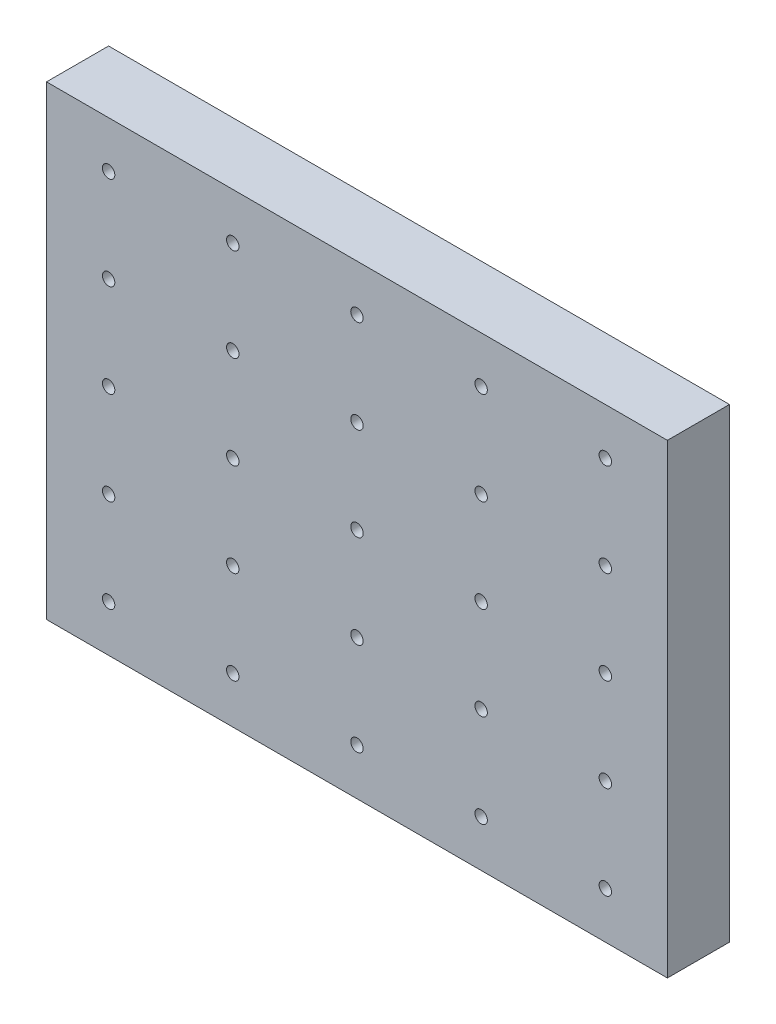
ISO-10303-21;
HEADER;
FILE_DESCRIPTION(('STEP AP214'),'2;1');
FILE_NAME('part.step','',(''),(''),'','','');
FILE_SCHEMA(('AUTOMOTIVE_DESIGN { 1 0 10303 214 1 1 1 1 }'));
ENDSEC;
DATA;
#1=APPLICATION_CONTEXT('core data for automotive mechanical design processes');
#2=APPLICATION_PROTOCOL_DEFINITION('international standard','automotive_design',2000,#1);
#3=PRODUCT_CONTEXT('',#1,'mechanical');
#4=PRODUCT('Part','Part','',(#3));
#5=PRODUCT_RELATED_PRODUCT_CATEGORY('part','',(#4));
#6=PRODUCT_DEFINITION_FORMATION('','',#4);
#7=PRODUCT_DEFINITION_CONTEXT('part definition',#1,'design');
#8=PRODUCT_DEFINITION('design','',#6,#7);
#9=PRODUCT_DEFINITION_SHAPE('','',#8);
#10=(LENGTH_UNIT() NAMED_UNIT(*) SI_UNIT(.MILLI.,.METRE.));
#11=(NAMED_UNIT(*) PLANE_ANGLE_UNIT() SI_UNIT($,.RADIAN.));
#12=(NAMED_UNIT(*) SI_UNIT($,.STERADIAN.) SOLID_ANGLE_UNIT());
#13=UNCERTAINTY_MEASURE_WITH_UNIT(LENGTH_MEASURE(1.E-05),#10,'distance_accuracy_value','');
#14=(GEOMETRIC_REPRESENTATION_CONTEXT(3) GLOBAL_UNCERTAINTY_ASSIGNED_CONTEXT((#13)) GLOBAL_UNIT_ASSIGNED_CONTEXT((#10,
#11,#12)) REPRESENTATION_CONTEXT('',''));
#15=CARTESIAN_POINT('',(0.,0.,0.));
#16=DIRECTION('',(0.,0.,1.));
#17=DIRECTION('',(1.,0.,0.));
#18=AXIS2_PLACEMENT_3D('',#15,#16,#17);
#19=CARTESIAN_POINT('',(180.,135.,20.));
#20=DIRECTION('',(0.,0.,-1.));
#21=DIRECTION('',(-1.,0.,0.));
#22=AXIS2_PLACEMENT_3D('',#19,#20,#21);
#23=CYLINDRICAL_SURFACE('',#22,2.);
#24=CARTESIAN_POINT('',(180.,135.,20.));
#25=DIRECTION('',(0.,0.,-1.));
#26=DIRECTION('',(-1.,0.,0.));
#27=AXIS2_PLACEMENT_3D('',#24,#25,#26);
#28=CIRCLE('',#27,2.);
#29=CARTESIAN_POINT('',(178.,135.,20.));
#30=VERTEX_POINT('',#29);
#31=EDGE_CURVE('E45',#30,#30,#28,.T.);
#32=ORIENTED_EDGE('',*,*,#31,.F.);
#33=EDGE_LOOP('',(#32));
#34=FACE_BOUND('',#33,.T.);
#35=CARTESIAN_POINT('',(180.,135.,0.));
#36=DIRECTION('',(0.,0.,-1.));
#37=DIRECTION('',(-1.,0.,0.));
#38=AXIS2_PLACEMENT_3D('',#35,#36,#37);
#39=CIRCLE('',#38,2.);
#40=CARTESIAN_POINT('',(178.,135.,0.));
#41=VERTEX_POINT('',#40);
#42=EDGE_CURVE('E11',#41,#41,#39,.T.);
#43=ORIENTED_EDGE('',*,*,#42,.T.);
#44=EDGE_LOOP('',(#43));
#45=FACE_BOUND('',#44,.T.);
#46=ADVANCED_FACE('F37',(#34,#45),#23,.F.);
#47=CARTESIAN_POINT('',(140.,135.,20.));
#48=DIRECTION('',(0.,0.,-1.));
#49=DIRECTION('',(-1.,0.,0.));
#50=AXIS2_PLACEMENT_3D('',#47,#48,#49);
#51=CYLINDRICAL_SURFACE('',#50,2.);
#52=CARTESIAN_POINT('',(140.,135.,20.));
#53=DIRECTION('',(0.,0.,-1.));
#54=DIRECTION('',(-1.,0.,0.));
#55=AXIS2_PLACEMENT_3D('',#52,#53,#54);
#56=CIRCLE('',#55,2.);
#57=CARTESIAN_POINT('',(138.,135.,20.));
#58=VERTEX_POINT('',#57);
#59=EDGE_CURVE('E241',#58,#58,#56,.T.);
#60=ORIENTED_EDGE('',*,*,#59,.F.);
#61=EDGE_LOOP('',(#60));
#62=FACE_BOUND('',#61,.T.);
#63=CARTESIAN_POINT('',(140.,135.,0.));
#64=DIRECTION('',(0.,0.,-1.));
#65=DIRECTION('',(-1.,0.,0.));
#66=AXIS2_PLACEMENT_3D('',#63,#64,#65);
#67=CIRCLE('',#66,2.);
#68=CARTESIAN_POINT('',(138.,135.,0.));
#69=VERTEX_POINT('',#68);
#70=EDGE_CURVE('E244',#69,#69,#67,.T.);
#71=ORIENTED_EDGE('',*,*,#70,.T.);
#72=EDGE_LOOP('',(#71));
#73=FACE_BOUND('',#72,.T.);
#74=ADVANCED_FACE('F252',(#62,#73),#51,.F.);
#75=CARTESIAN_POINT('',(100.,135.,20.));
#76=DIRECTION('',(0.,0.,-1.));
#77=DIRECTION('',(-1.,0.,0.));
#78=AXIS2_PLACEMENT_3D('',#75,#76,#77);
#79=CYLINDRICAL_SURFACE('',#78,2.);
#80=CARTESIAN_POINT('',(100.,135.,20.));
#81=DIRECTION('',(0.,0.,-1.));
#82=DIRECTION('',(-1.,0.,0.));
#83=AXIS2_PLACEMENT_3D('',#80,#81,#82);
#84=CIRCLE('',#83,2.);
#85=CARTESIAN_POINT('',(98.,135.,20.));
#86=VERTEX_POINT('',#85);
#87=EDGE_CURVE('E235',#86,#86,#84,.T.);
#88=ORIENTED_EDGE('',*,*,#87,.F.);
#89=EDGE_LOOP('',(#88));
#90=FACE_BOUND('',#89,.T.);
#91=CARTESIAN_POINT('',(100.,135.,0.));
#92=DIRECTION('',(0.,0.,-1.));
#93=DIRECTION('',(-1.,0.,0.));
#94=AXIS2_PLACEMENT_3D('',#91,#92,#93);
#95=CIRCLE('',#94,2.);
#96=CARTESIAN_POINT('',(98.,135.,0.));
#97=VERTEX_POINT('',#96);
#98=EDGE_CURVE('E238',#97,#97,#95,.T.);
#99=ORIENTED_EDGE('',*,*,#98,.T.);
#100=EDGE_LOOP('',(#99));
#101=FACE_BOUND('',#100,.T.);
#102=ADVANCED_FACE('F362',(#90,#101),#79,.F.);
#103=CARTESIAN_POINT('',(60.,135.,20.));
#104=DIRECTION('',(0.,0.,-1.));
#105=DIRECTION('',(-1.,0.,0.));
#106=AXIS2_PLACEMENT_3D('',#103,#104,#105);
#107=CYLINDRICAL_SURFACE('',#106,2.);
#108=CARTESIAN_POINT('',(60.,135.,20.));
#109=DIRECTION('',(0.,0.,-1.));
#110=DIRECTION('',(-1.,0.,0.));
#111=AXIS2_PLACEMENT_3D('',#108,#109,#110);
#112=CIRCLE('',#111,2.);
#113=CARTESIAN_POINT('',(58.,135.,20.));
#114=VERTEX_POINT('',#113);
#115=EDGE_CURVE('E229',#114,#114,#112,.T.);
#116=ORIENTED_EDGE('',*,*,#115,.F.);
#117=EDGE_LOOP('',(#116));
#118=FACE_BOUND('',#117,.T.);
#119=CARTESIAN_POINT('',(60.,135.,0.));
#120=DIRECTION('',(0.,0.,-1.));
#121=DIRECTION('',(-1.,0.,0.));
#122=AXIS2_PLACEMENT_3D('',#119,#120,#121);
#123=CIRCLE('',#122,2.);
#124=CARTESIAN_POINT('',(58.,135.,0.));
#125=VERTEX_POINT('',#124);
#126=EDGE_CURVE('E232',#125,#125,#123,.T.);
#127=ORIENTED_EDGE('',*,*,#126,.T.);
#128=EDGE_LOOP('',(#127));
#129=FACE_BOUND('',#128,.T.);
#130=ADVANCED_FACE('F358',(#118,#129),#107,.F.);
#131=CARTESIAN_POINT('',(20.,135.,20.));
#132=DIRECTION('',(0.,0.,-1.));
#133=DIRECTION('',(-1.,0.,0.));
#134=AXIS2_PLACEMENT_3D('',#131,#132,#133);
#135=CYLINDRICAL_SURFACE('',#134,2.);
#136=CARTESIAN_POINT('',(20.,135.,20.));
#137=DIRECTION('',(0.,0.,-1.));
#138=DIRECTION('',(-1.,0.,0.));
#139=AXIS2_PLACEMENT_3D('',#136,#137,#138);
#140=CIRCLE('',#139,2.);
#141=CARTESIAN_POINT('',(18.,135.,20.));
#142=VERTEX_POINT('',#141);
#143=EDGE_CURVE('E223',#142,#142,#140,.T.);
#144=ORIENTED_EDGE('',*,*,#143,.F.);
#145=EDGE_LOOP('',(#144));
#146=FACE_BOUND('',#145,.T.);
#147=CARTESIAN_POINT('',(20.,135.,0.));
#148=DIRECTION('',(0.,0.,-1.));
#149=DIRECTION('',(-1.,0.,0.));
#150=AXIS2_PLACEMENT_3D('',#147,#148,#149);
#151=CIRCLE('',#150,2.);
#152=CARTESIAN_POINT('',(18.,135.,0.));
#153=VERTEX_POINT('',#152);
#154=EDGE_CURVE('E226',#153,#153,#151,.T.);
#155=ORIENTED_EDGE('',*,*,#154,.T.);
#156=EDGE_LOOP('',(#155));
#157=FACE_BOUND('',#156,.T.);
#158=ADVANCED_FACE('F354',(#146,#157),#135,.F.);
#159=CARTESIAN_POINT('',(180.,105.,20.));
#160=DIRECTION('',(0.,0.,-1.));
#161=DIRECTION('',(-1.,0.,0.));
#162=AXIS2_PLACEMENT_3D('',#159,#160,#161);
#163=CYLINDRICAL_SURFACE('',#162,2.);
#164=CARTESIAN_POINT('',(180.,105.,20.));
#165=DIRECTION('',(0.,0.,-1.));
#166=DIRECTION('',(-1.,0.,0.));
#167=AXIS2_PLACEMENT_3D('',#164,#165,#166);
#168=CIRCLE('',#167,2.);
#169=CARTESIAN_POINT('',(178.,105.,20.));
#170=VERTEX_POINT('',#169);
#171=EDGE_CURVE('E217',#170,#170,#168,.T.);
#172=ORIENTED_EDGE('',*,*,#171,.F.);
#173=EDGE_LOOP('',(#172));
#174=FACE_BOUND('',#173,.T.);
#175=CARTESIAN_POINT('',(180.,105.,0.));
#176=DIRECTION('',(0.,0.,-1.));
#177=DIRECTION('',(-1.,0.,0.));
#178=AXIS2_PLACEMENT_3D('',#175,#176,#177);
#179=CIRCLE('',#178,2.);
#180=CARTESIAN_POINT('',(178.,105.,0.));
#181=VERTEX_POINT('',#180);
#182=EDGE_CURVE('E220',#181,#181,#179,.T.);
#183=ORIENTED_EDGE('',*,*,#182,.T.);
#184=EDGE_LOOP('',(#183));
#185=FACE_BOUND('',#184,.T.);
#186=ADVANCED_FACE('F350',(#174,#185),#163,.F.);
#187=CARTESIAN_POINT('',(140.,105.,20.));
#188=DIRECTION('',(0.,0.,-1.));
#189=DIRECTION('',(-1.,0.,0.));
#190=AXIS2_PLACEMENT_3D('',#187,#188,#189);
#191=CYLINDRICAL_SURFACE('',#190,2.);
#192=CARTESIAN_POINT('',(140.,105.,20.));
#193=DIRECTION('',(0.,0.,-1.));
#194=DIRECTION('',(-1.,0.,0.));
#195=AXIS2_PLACEMENT_3D('',#192,#193,#194);
#196=CIRCLE('',#195,2.);
#197=CARTESIAN_POINT('',(138.,105.,20.));
#198=VERTEX_POINT('',#197);
#199=EDGE_CURVE('E211',#198,#198,#196,.T.);
#200=ORIENTED_EDGE('',*,*,#199,.F.);
#201=EDGE_LOOP('',(#200));
#202=FACE_BOUND('',#201,.T.);
#203=CARTESIAN_POINT('',(140.,105.,0.));
#204=DIRECTION('',(0.,0.,-1.));
#205=DIRECTION('',(-1.,0.,0.));
#206=AXIS2_PLACEMENT_3D('',#203,#204,#205);
#207=CIRCLE('',#206,2.);
#208=CARTESIAN_POINT('',(138.,105.,0.));
#209=VERTEX_POINT('',#208);
#210=EDGE_CURVE('E214',#209,#209,#207,.T.);
#211=ORIENTED_EDGE('',*,*,#210,.T.);
#212=EDGE_LOOP('',(#211));
#213=FACE_BOUND('',#212,.T.);
#214=ADVANCED_FACE('F346',(#202,#213),#191,.F.);
#215=CARTESIAN_POINT('',(100.,105.,20.));
#216=DIRECTION('',(0.,0.,-1.));
#217=DIRECTION('',(-1.,0.,0.));
#218=AXIS2_PLACEMENT_3D('',#215,#216,#217);
#219=CYLINDRICAL_SURFACE('',#218,2.);
#220=CARTESIAN_POINT('',(100.,105.,20.));
#221=DIRECTION('',(0.,0.,-1.));
#222=DIRECTION('',(-1.,0.,0.));
#223=AXIS2_PLACEMENT_3D('',#220,#221,#222);
#224=CIRCLE('',#223,2.);
#225=CARTESIAN_POINT('',(98.,105.,20.));
#226=VERTEX_POINT('',#225);
#227=EDGE_CURVE('E205',#226,#226,#224,.T.);
#228=ORIENTED_EDGE('',*,*,#227,.F.);
#229=EDGE_LOOP('',(#228));
#230=FACE_BOUND('',#229,.T.);
#231=CARTESIAN_POINT('',(100.,105.,0.));
#232=DIRECTION('',(0.,0.,-1.));
#233=DIRECTION('',(-1.,0.,0.));
#234=AXIS2_PLACEMENT_3D('',#231,#232,#233);
#235=CIRCLE('',#234,2.);
#236=CARTESIAN_POINT('',(98.,105.,0.));
#237=VERTEX_POINT('',#236);
#238=EDGE_CURVE('E208',#237,#237,#235,.T.);
#239=ORIENTED_EDGE('',*,*,#238,.T.);
#240=EDGE_LOOP('',(#239));
#241=FACE_BOUND('',#240,.T.);
#242=ADVANCED_FACE('F342',(#230,#241),#219,.F.);
#243=CARTESIAN_POINT('',(60.,105.,20.));
#244=DIRECTION('',(0.,0.,-1.));
#245=DIRECTION('',(-1.,0.,0.));
#246=AXIS2_PLACEMENT_3D('',#243,#244,#245);
#247=CYLINDRICAL_SURFACE('',#246,2.);
#248=CARTESIAN_POINT('',(60.,105.,20.));
#249=DIRECTION('',(0.,0.,-1.));
#250=DIRECTION('',(-1.,0.,0.));
#251=AXIS2_PLACEMENT_3D('',#248,#249,#250);
#252=CIRCLE('',#251,2.);
#253=CARTESIAN_POINT('',(58.,105.,20.));
#254=VERTEX_POINT('',#253);
#255=EDGE_CURVE('E199',#254,#254,#252,.T.);
#256=ORIENTED_EDGE('',*,*,#255,.F.);
#257=EDGE_LOOP('',(#256));
#258=FACE_BOUND('',#257,.T.);
#259=CARTESIAN_POINT('',(60.,105.,0.));
#260=DIRECTION('',(0.,0.,-1.));
#261=DIRECTION('',(-1.,0.,0.));
#262=AXIS2_PLACEMENT_3D('',#259,#260,#261);
#263=CIRCLE('',#262,2.);
#264=CARTESIAN_POINT('',(58.,105.,0.));
#265=VERTEX_POINT('',#264);
#266=EDGE_CURVE('E202',#265,#265,#263,.T.);
#267=ORIENTED_EDGE('',*,*,#266,.T.);
#268=EDGE_LOOP('',(#267));
#269=FACE_BOUND('',#268,.T.);
#270=ADVANCED_FACE('F338',(#258,#269),#247,.F.);
#271=CARTESIAN_POINT('',(20.,105.,20.));
#272=DIRECTION('',(0.,0.,-1.));
#273=DIRECTION('',(-1.,0.,0.));
#274=AXIS2_PLACEMENT_3D('',#271,#272,#273);
#275=CYLINDRICAL_SURFACE('',#274,2.);
#276=CARTESIAN_POINT('',(20.,105.,20.));
#277=DIRECTION('',(0.,0.,-1.));
#278=DIRECTION('',(-1.,0.,0.));
#279=AXIS2_PLACEMENT_3D('',#276,#277,#278);
#280=CIRCLE('',#279,2.);
#281=CARTESIAN_POINT('',(18.,105.,20.));
#282=VERTEX_POINT('',#281);
#283=EDGE_CURVE('E193',#282,#282,#280,.T.);
#284=ORIENTED_EDGE('',*,*,#283,.F.);
#285=EDGE_LOOP('',(#284));
#286=FACE_BOUND('',#285,.T.);
#287=CARTESIAN_POINT('',(20.,105.,0.));
#288=DIRECTION('',(0.,0.,-1.));
#289=DIRECTION('',(-1.,0.,0.));
#290=AXIS2_PLACEMENT_3D('',#287,#288,#289);
#291=CIRCLE('',#290,2.);
#292=CARTESIAN_POINT('',(18.,105.,0.));
#293=VERTEX_POINT('',#292);
#294=EDGE_CURVE('E196',#293,#293,#291,.T.);
#295=ORIENTED_EDGE('',*,*,#294,.T.);
#296=EDGE_LOOP('',(#295));
#297=FACE_BOUND('',#296,.T.);
#298=ADVANCED_FACE('F334',(#286,#297),#275,.F.);
#299=CARTESIAN_POINT('',(180.,75.,20.));
#300=DIRECTION('',(0.,0.,-1.));
#301=DIRECTION('',(-1.,0.,0.));
#302=AXIS2_PLACEMENT_3D('',#299,#300,#301);
#303=CYLINDRICAL_SURFACE('',#302,2.);
#304=CARTESIAN_POINT('',(180.,75.,20.));
#305=DIRECTION('',(0.,0.,-1.));
#306=DIRECTION('',(-1.,0.,0.));
#307=AXIS2_PLACEMENT_3D('',#304,#305,#306);
#308=CIRCLE('',#307,2.);
#309=CARTESIAN_POINT('',(178.,75.,20.));
#310=VERTEX_POINT('',#309);
#311=EDGE_CURVE('E187',#310,#310,#308,.T.);
#312=ORIENTED_EDGE('',*,*,#311,.F.);
#313=EDGE_LOOP('',(#312));
#314=FACE_BOUND('',#313,.T.);
#315=CARTESIAN_POINT('',(180.,75.,0.));
#316=DIRECTION('',(0.,0.,-1.));
#317=DIRECTION('',(-1.,0.,0.));
#318=AXIS2_PLACEMENT_3D('',#315,#316,#317);
#319=CIRCLE('',#318,2.);
#320=CARTESIAN_POINT('',(178.,75.,0.));
#321=VERTEX_POINT('',#320);
#322=EDGE_CURVE('E190',#321,#321,#319,.T.);
#323=ORIENTED_EDGE('',*,*,#322,.T.);
#324=EDGE_LOOP('',(#323));
#325=FACE_BOUND('',#324,.T.);
#326=ADVANCED_FACE('F330',(#314,#325),#303,.F.);
#327=CARTESIAN_POINT('',(140.,75.,20.));
#328=DIRECTION('',(0.,0.,-1.));
#329=DIRECTION('',(-1.,0.,0.));
#330=AXIS2_PLACEMENT_3D('',#327,#328,#329);
#331=CYLINDRICAL_SURFACE('',#330,2.);
#332=CARTESIAN_POINT('',(140.,75.,20.));
#333=DIRECTION('',(0.,0.,-1.));
#334=DIRECTION('',(-1.,0.,0.));
#335=AXIS2_PLACEMENT_3D('',#332,#333,#334);
#336=CIRCLE('',#335,2.);
#337=CARTESIAN_POINT('',(138.,75.,20.));
#338=VERTEX_POINT('',#337);
#339=EDGE_CURVE('E181',#338,#338,#336,.T.);
#340=ORIENTED_EDGE('',*,*,#339,.F.);
#341=EDGE_LOOP('',(#340));
#342=FACE_BOUND('',#341,.T.);
#343=CARTESIAN_POINT('',(140.,75.,0.));
#344=DIRECTION('',(0.,0.,-1.));
#345=DIRECTION('',(-1.,0.,0.));
#346=AXIS2_PLACEMENT_3D('',#343,#344,#345);
#347=CIRCLE('',#346,2.);
#348=CARTESIAN_POINT('',(138.,75.,0.));
#349=VERTEX_POINT('',#348);
#350=EDGE_CURVE('E184',#349,#349,#347,.T.);
#351=ORIENTED_EDGE('',*,*,#350,.T.);
#352=EDGE_LOOP('',(#351));
#353=FACE_BOUND('',#352,.T.);
#354=ADVANCED_FACE('F326',(#342,#353),#331,.F.);
#355=CARTESIAN_POINT('',(100.,75.,20.));
#356=DIRECTION('',(0.,0.,-1.));
#357=DIRECTION('',(-1.,0.,0.));
#358=AXIS2_PLACEMENT_3D('',#355,#356,#357);
#359=CYLINDRICAL_SURFACE('',#358,2.);
#360=CARTESIAN_POINT('',(100.,75.,20.));
#361=DIRECTION('',(0.,0.,-1.));
#362=DIRECTION('',(-1.,0.,0.));
#363=AXIS2_PLACEMENT_3D('',#360,#361,#362);
#364=CIRCLE('',#363,2.);
#365=CARTESIAN_POINT('',(98.,75.,20.));
#366=VERTEX_POINT('',#365);
#367=EDGE_CURVE('E175',#366,#366,#364,.T.);
#368=ORIENTED_EDGE('',*,*,#367,.F.);
#369=EDGE_LOOP('',(#368));
#370=FACE_BOUND('',#369,.T.);
#371=CARTESIAN_POINT('',(100.,75.,0.));
#372=DIRECTION('',(0.,0.,-1.));
#373=DIRECTION('',(-1.,0.,0.));
#374=AXIS2_PLACEMENT_3D('',#371,#372,#373);
#375=CIRCLE('',#374,2.);
#376=CARTESIAN_POINT('',(98.,75.,0.));
#377=VERTEX_POINT('',#376);
#378=EDGE_CURVE('E178',#377,#377,#375,.T.);
#379=ORIENTED_EDGE('',*,*,#378,.T.);
#380=EDGE_LOOP('',(#379));
#381=FACE_BOUND('',#380,.T.);
#382=ADVANCED_FACE('F322',(#370,#381),#359,.F.);
#383=CARTESIAN_POINT('',(60.,75.,20.));
#384=DIRECTION('',(0.,0.,-1.));
#385=DIRECTION('',(-1.,0.,0.));
#386=AXIS2_PLACEMENT_3D('',#383,#384,#385);
#387=CYLINDRICAL_SURFACE('',#386,2.);
#388=CARTESIAN_POINT('',(60.,75.,20.));
#389=DIRECTION('',(0.,0.,-1.));
#390=DIRECTION('',(-1.,0.,0.));
#391=AXIS2_PLACEMENT_3D('',#388,#389,#390);
#392=CIRCLE('',#391,2.);
#393=CARTESIAN_POINT('',(58.,75.,20.));
#394=VERTEX_POINT('',#393);
#395=EDGE_CURVE('E169',#394,#394,#392,.T.);
#396=ORIENTED_EDGE('',*,*,#395,.F.);
#397=EDGE_LOOP('',(#396));
#398=FACE_BOUND('',#397,.T.);
#399=CARTESIAN_POINT('',(60.,75.,0.));
#400=DIRECTION('',(0.,0.,-1.));
#401=DIRECTION('',(-1.,0.,0.));
#402=AXIS2_PLACEMENT_3D('',#399,#400,#401);
#403=CIRCLE('',#402,2.);
#404=CARTESIAN_POINT('',(58.,75.,0.));
#405=VERTEX_POINT('',#404);
#406=EDGE_CURVE('E172',#405,#405,#403,.T.);
#407=ORIENTED_EDGE('',*,*,#406,.T.);
#408=EDGE_LOOP('',(#407));
#409=FACE_BOUND('',#408,.T.);
#410=ADVANCED_FACE('F318',(#398,#409),#387,.F.);
#411=CARTESIAN_POINT('',(20.,75.,20.));
#412=DIRECTION('',(0.,0.,-1.));
#413=DIRECTION('',(-1.,0.,0.));
#414=AXIS2_PLACEMENT_3D('',#411,#412,#413);
#415=CYLINDRICAL_SURFACE('',#414,2.);
#416=CARTESIAN_POINT('',(20.,75.,20.));
#417=DIRECTION('',(0.,0.,-1.));
#418=DIRECTION('',(-1.,0.,0.));
#419=AXIS2_PLACEMENT_3D('',#416,#417,#418);
#420=CIRCLE('',#419,2.);
#421=CARTESIAN_POINT('',(18.,75.,20.));
#422=VERTEX_POINT('',#421);
#423=EDGE_CURVE('E163',#422,#422,#420,.T.);
#424=ORIENTED_EDGE('',*,*,#423,.F.);
#425=EDGE_LOOP('',(#424));
#426=FACE_BOUND('',#425,.T.);
#427=CARTESIAN_POINT('',(20.,75.,0.));
#428=DIRECTION('',(0.,0.,-1.));
#429=DIRECTION('',(-1.,0.,0.));
#430=AXIS2_PLACEMENT_3D('',#427,#428,#429);
#431=CIRCLE('',#430,2.);
#432=CARTESIAN_POINT('',(18.,75.,0.));
#433=VERTEX_POINT('',#432);
#434=EDGE_CURVE('E166',#433,#433,#431,.T.);
#435=ORIENTED_EDGE('',*,*,#434,.T.);
#436=EDGE_LOOP('',(#435));
#437=FACE_BOUND('',#436,.T.);
#438=ADVANCED_FACE('F314',(#426,#437),#415,.F.);
#439=CARTESIAN_POINT('',(180.,45.,20.));
#440=DIRECTION('',(0.,0.,-1.));
#441=DIRECTION('',(-1.,0.,0.));
#442=AXIS2_PLACEMENT_3D('',#439,#440,#441);
#443=CYLINDRICAL_SURFACE('',#442,2.);
#444=CARTESIAN_POINT('',(180.,45.,20.));
#445=DIRECTION('',(0.,0.,-1.));
#446=DIRECTION('',(-1.,0.,0.));
#447=AXIS2_PLACEMENT_3D('',#444,#445,#446);
#448=CIRCLE('',#447,2.);
#449=CARTESIAN_POINT('',(178.,45.,20.));
#450=VERTEX_POINT('',#449);
#451=EDGE_CURVE('E157',#450,#450,#448,.T.);
#452=ORIENTED_EDGE('',*,*,#451,.F.);
#453=EDGE_LOOP('',(#452));
#454=FACE_BOUND('',#453,.T.);
#455=CARTESIAN_POINT('',(180.,45.,0.));
#456=DIRECTION('',(0.,0.,-1.));
#457=DIRECTION('',(-1.,0.,0.));
#458=AXIS2_PLACEMENT_3D('',#455,#456,#457);
#459=CIRCLE('',#458,2.);
#460=CARTESIAN_POINT('',(178.,45.,0.));
#461=VERTEX_POINT('',#460);
#462=EDGE_CURVE('E160',#461,#461,#459,.T.);
#463=ORIENTED_EDGE('',*,*,#462,.T.);
#464=EDGE_LOOP('',(#463));
#465=FACE_BOUND('',#464,.T.);
#466=ADVANCED_FACE('F310',(#454,#465),#443,.F.);
#467=CARTESIAN_POINT('',(140.,45.,20.));
#468=DIRECTION('',(0.,0.,-1.));
#469=DIRECTION('',(-1.,0.,0.));
#470=AXIS2_PLACEMENT_3D('',#467,#468,#469);
#471=CYLINDRICAL_SURFACE('',#470,2.);
#472=CARTESIAN_POINT('',(140.,45.,20.));
#473=DIRECTION('',(0.,0.,-1.));
#474=DIRECTION('',(-1.,0.,0.));
#475=AXIS2_PLACEMENT_3D('',#472,#473,#474);
#476=CIRCLE('',#475,2.);
#477=CARTESIAN_POINT('',(138.,45.,20.));
#478=VERTEX_POINT('',#477);
#479=EDGE_CURVE('E151',#478,#478,#476,.T.);
#480=ORIENTED_EDGE('',*,*,#479,.F.);
#481=EDGE_LOOP('',(#480));
#482=FACE_BOUND('',#481,.T.);
#483=CARTESIAN_POINT('',(140.,45.,0.));
#484=DIRECTION('',(0.,0.,-1.));
#485=DIRECTION('',(-1.,0.,0.));
#486=AXIS2_PLACEMENT_3D('',#483,#484,#485);
#487=CIRCLE('',#486,2.);
#488=CARTESIAN_POINT('',(138.,45.,0.));
#489=VERTEX_POINT('',#488);
#490=EDGE_CURVE('E154',#489,#489,#487,.T.);
#491=ORIENTED_EDGE('',*,*,#490,.T.);
#492=EDGE_LOOP('',(#491));
#493=FACE_BOUND('',#492,.T.);
#494=ADVANCED_FACE('F306',(#482,#493),#471,.F.);
#495=CARTESIAN_POINT('',(100.,45.,20.));
#496=DIRECTION('',(0.,0.,-1.));
#497=DIRECTION('',(-1.,0.,0.));
#498=AXIS2_PLACEMENT_3D('',#495,#496,#497);
#499=CYLINDRICAL_SURFACE('',#498,2.);
#500=CARTESIAN_POINT('',(100.,45.,20.));
#501=DIRECTION('',(0.,0.,-1.));
#502=DIRECTION('',(-1.,0.,0.));
#503=AXIS2_PLACEMENT_3D('',#500,#501,#502);
#504=CIRCLE('',#503,2.);
#505=CARTESIAN_POINT('',(98.,45.,20.));
#506=VERTEX_POINT('',#505);
#507=EDGE_CURVE('E145',#506,#506,#504,.T.);
#508=ORIENTED_EDGE('',*,*,#507,.F.);
#509=EDGE_LOOP('',(#508));
#510=FACE_BOUND('',#509,.T.);
#511=CARTESIAN_POINT('',(100.,45.,0.));
#512=DIRECTION('',(0.,0.,-1.));
#513=DIRECTION('',(-1.,0.,0.));
#514=AXIS2_PLACEMENT_3D('',#511,#512,#513);
#515=CIRCLE('',#514,2.);
#516=CARTESIAN_POINT('',(98.,45.,0.));
#517=VERTEX_POINT('',#516);
#518=EDGE_CURVE('E148',#517,#517,#515,.T.);
#519=ORIENTED_EDGE('',*,*,#518,.T.);
#520=EDGE_LOOP('',(#519));
#521=FACE_BOUND('',#520,.T.);
#522=ADVANCED_FACE('F302',(#510,#521),#499,.F.);
#523=CARTESIAN_POINT('',(60.,45.,20.));
#524=DIRECTION('',(0.,0.,-1.));
#525=DIRECTION('',(-1.,0.,0.));
#526=AXIS2_PLACEMENT_3D('',#523,#524,#525);
#527=CYLINDRICAL_SURFACE('',#526,2.);
#528=CARTESIAN_POINT('',(60.,45.,20.));
#529=DIRECTION('',(0.,0.,-1.));
#530=DIRECTION('',(-1.,0.,0.));
#531=AXIS2_PLACEMENT_3D('',#528,#529,#530);
#532=CIRCLE('',#531,2.);
#533=CARTESIAN_POINT('',(58.,45.,20.));
#534=VERTEX_POINT('',#533);
#535=EDGE_CURVE('E139',#534,#534,#532,.T.);
#536=ORIENTED_EDGE('',*,*,#535,.F.);
#537=EDGE_LOOP('',(#536));
#538=FACE_BOUND('',#537,.T.);
#539=CARTESIAN_POINT('',(60.,45.,0.));
#540=DIRECTION('',(0.,0.,-1.));
#541=DIRECTION('',(-1.,0.,0.));
#542=AXIS2_PLACEMENT_3D('',#539,#540,#541);
#543=CIRCLE('',#542,2.);
#544=CARTESIAN_POINT('',(58.,45.,0.));
#545=VERTEX_POINT('',#544);
#546=EDGE_CURVE('E142',#545,#545,#543,.T.);
#547=ORIENTED_EDGE('',*,*,#546,.T.);
#548=EDGE_LOOP('',(#547));
#549=FACE_BOUND('',#548,.T.);
#550=ADVANCED_FACE('F298',(#538,#549),#527,.F.);
#551=CARTESIAN_POINT('',(20.,45.,20.));
#552=DIRECTION('',(0.,0.,-1.));
#553=DIRECTION('',(-1.,0.,0.));
#554=AXIS2_PLACEMENT_3D('',#551,#552,#553);
#555=CYLINDRICAL_SURFACE('',#554,2.);
#556=CARTESIAN_POINT('',(20.,45.,20.));
#557=DIRECTION('',(0.,0.,-1.));
#558=DIRECTION('',(-1.,0.,0.));
#559=AXIS2_PLACEMENT_3D('',#556,#557,#558);
#560=CIRCLE('',#559,2.);
#561=CARTESIAN_POINT('',(18.,45.,20.));
#562=VERTEX_POINT('',#561);
#563=EDGE_CURVE('E133',#562,#562,#560,.T.);
#564=ORIENTED_EDGE('',*,*,#563,.F.);
#565=EDGE_LOOP('',(#564));
#566=FACE_BOUND('',#565,.T.);
#567=CARTESIAN_POINT('',(20.,45.,0.));
#568=DIRECTION('',(0.,0.,-1.));
#569=DIRECTION('',(-1.,0.,0.));
#570=AXIS2_PLACEMENT_3D('',#567,#568,#569);
#571=CIRCLE('',#570,2.);
#572=CARTESIAN_POINT('',(18.,45.,0.));
#573=VERTEX_POINT('',#572);
#574=EDGE_CURVE('E136',#573,#573,#571,.T.);
#575=ORIENTED_EDGE('',*,*,#574,.T.);
#576=EDGE_LOOP('',(#575));
#577=FACE_BOUND('',#576,.T.);
#578=ADVANCED_FACE('F294',(#566,#577),#555,.F.);
#579=CARTESIAN_POINT('',(180.,15.,20.));
#580=DIRECTION('',(0.,0.,-1.));
#581=DIRECTION('',(-1.,0.,0.));
#582=AXIS2_PLACEMENT_3D('',#579,#580,#581);
#583=CYLINDRICAL_SURFACE('',#582,2.);
#584=CARTESIAN_POINT('',(180.,15.,20.));
#585=DIRECTION('',(0.,0.,-1.));
#586=DIRECTION('',(-1.,0.,0.));
#587=AXIS2_PLACEMENT_3D('',#584,#585,#586);
#588=CIRCLE('',#587,2.);
#589=CARTESIAN_POINT('',(178.,15.,20.));
#590=VERTEX_POINT('',#589);
#591=EDGE_CURVE('E127',#590,#590,#588,.T.);
#592=ORIENTED_EDGE('',*,*,#591,.F.);
#593=EDGE_LOOP('',(#592));
#594=FACE_BOUND('',#593,.T.);
#595=CARTESIAN_POINT('',(180.,15.,0.));
#596=DIRECTION('',(0.,0.,-1.));
#597=DIRECTION('',(-1.,0.,0.));
#598=AXIS2_PLACEMENT_3D('',#595,#596,#597);
#599=CIRCLE('',#598,2.);
#600=CARTESIAN_POINT('',(178.,15.,0.));
#601=VERTEX_POINT('',#600);
#602=EDGE_CURVE('E130',#601,#601,#599,.T.);
#603=ORIENTED_EDGE('',*,*,#602,.T.);
#604=EDGE_LOOP('',(#603));
#605=FACE_BOUND('',#604,.T.);
#606=ADVANCED_FACE('F290',(#594,#605),#583,.F.);
#607=CARTESIAN_POINT('',(140.,15.,20.));
#608=DIRECTION('',(0.,0.,-1.));
#609=DIRECTION('',(-1.,0.,0.));
#610=AXIS2_PLACEMENT_3D('',#607,#608,#609);
#611=CYLINDRICAL_SURFACE('',#610,2.);
#612=CARTESIAN_POINT('',(140.,15.,20.));
#613=DIRECTION('',(0.,0.,-1.));
#614=DIRECTION('',(-1.,0.,0.));
#615=AXIS2_PLACEMENT_3D('',#612,#613,#614);
#616=CIRCLE('',#615,2.);
#617=CARTESIAN_POINT('',(138.,15.,20.));
#618=VERTEX_POINT('',#617);
#619=EDGE_CURVE('E121',#618,#618,#616,.T.);
#620=ORIENTED_EDGE('',*,*,#619,.F.);
#621=EDGE_LOOP('',(#620));
#622=FACE_BOUND('',#621,.T.);
#623=CARTESIAN_POINT('',(140.,15.,0.));
#624=DIRECTION('',(0.,0.,-1.));
#625=DIRECTION('',(-1.,0.,0.));
#626=AXIS2_PLACEMENT_3D('',#623,#624,#625);
#627=CIRCLE('',#626,2.);
#628=CARTESIAN_POINT('',(138.,15.,0.));
#629=VERTEX_POINT('',#628);
#630=EDGE_CURVE('E124',#629,#629,#627,.T.);
#631=ORIENTED_EDGE('',*,*,#630,.T.);
#632=EDGE_LOOP('',(#631));
#633=FACE_BOUND('',#632,.T.);
#634=ADVANCED_FACE('F286',(#622,#633),#611,.F.);
#635=CARTESIAN_POINT('',(100.,15.,20.));
#636=DIRECTION('',(0.,0.,-1.));
#637=DIRECTION('',(-1.,0.,0.));
#638=AXIS2_PLACEMENT_3D('',#635,#636,#637);
#639=CYLINDRICAL_SURFACE('',#638,2.);
#640=CARTESIAN_POINT('',(100.,15.,20.));
#641=DIRECTION('',(0.,0.,-1.));
#642=DIRECTION('',(-1.,0.,0.));
#643=AXIS2_PLACEMENT_3D('',#640,#641,#642);
#644=CIRCLE('',#643,2.);
#645=CARTESIAN_POINT('',(98.,15.,20.));
#646=VERTEX_POINT('',#645);
#647=EDGE_CURVE('E115',#646,#646,#644,.T.);
#648=ORIENTED_EDGE('',*,*,#647,.F.);
#649=EDGE_LOOP('',(#648));
#650=FACE_BOUND('',#649,.T.);
#651=CARTESIAN_POINT('',(100.,15.,0.));
#652=DIRECTION('',(0.,0.,-1.));
#653=DIRECTION('',(-1.,0.,0.));
#654=AXIS2_PLACEMENT_3D('',#651,#652,#653);
#655=CIRCLE('',#654,2.);
#656=CARTESIAN_POINT('',(98.,15.,0.));
#657=VERTEX_POINT('',#656);
#658=EDGE_CURVE('E118',#657,#657,#655,.T.);
#659=ORIENTED_EDGE('',*,*,#658,.T.);
#660=EDGE_LOOP('',(#659));
#661=FACE_BOUND('',#660,.T.);
#662=ADVANCED_FACE('F282',(#650,#661),#639,.F.);
#663=CARTESIAN_POINT('',(0.,0.,20.));
#664=DIRECTION('',(1.,0.,0.));
#665=DIRECTION('',(0.,0.,-1.));
#666=AXIS2_PLACEMENT_3D('',#663,#664,#665);
#667=PLANE('',#666);
#668=DIRECTION('',(0.,-1.,0.));
#669=VECTOR('',#668,1.);
#670=CARTESIAN_POINT('',(0.,0.,0.));
#671=LINE('',#670,#669);
#672=CARTESIAN_POINT('',(0.,150.,0.));
#673=VERTEX_POINT('',#672);
#674=CARTESIAN_POINT('',(0.,0.,0.));
#675=VERTEX_POINT('',#674);
#676=EDGE_CURVE('E105',#673,#675,#671,.T.);
#677=ORIENTED_EDGE('',*,*,#676,.T.);
#678=DIRECTION('',(0.,0.,-1.));
#679=VECTOR('',#678,1.);
#680=CARTESIAN_POINT('',(0.,0.,20.));
#681=LINE('',#680,#679);
#682=CARTESIAN_POINT('',(0.,0.,20.));
#683=VERTEX_POINT('',#682);
#684=EDGE_CURVE('E96',#683,#675,#681,.T.);
#685=ORIENTED_EDGE('',*,*,#684,.F.);
#686=DIRECTION('',(0.,-1.,0.));
#687=VECTOR('',#686,1.);
#688=CARTESIAN_POINT('',(0.,0.,20.));
#689=LINE('',#688,#687);
#690=CARTESIAN_POINT('',(0.,150.,20.));
#691=VERTEX_POINT('',#690);
#692=EDGE_CURVE('E90',#691,#683,#689,.T.);
#693=ORIENTED_EDGE('',*,*,#692,.F.);
#694=DIRECTION('',(0.,0.,-1.));
#695=VECTOR('',#694,1.);
#696=CARTESIAN_POINT('',(0.,150.,20.));
#697=LINE('',#696,#695);
#698=EDGE_CURVE('E101',#691,#673,#697,.T.);
#699=ORIENTED_EDGE('',*,*,#698,.T.);
#700=EDGE_LOOP('',(#677,#685,#693,#699));
#701=FACE_BOUND('',#700,.T.);
#702=ADVANCED_FACE('F279',(#701),#667,.F.);
#703=CARTESIAN_POINT('',(0.,0.,20.));
#704=DIRECTION('',(0.,1.,0.));
#705=DIRECTION('',(0.,0.,1.));
#706=AXIS2_PLACEMENT_3D('',#703,#704,#705);
#707=PLANE('',#706);
#708=DIRECTION('',(1.,0.,0.));
#709=VECTOR('',#708,1.);
#710=CARTESIAN_POINT('',(0.,0.,0.));
#711=LINE('',#710,#709);
#712=CARTESIAN_POINT('',(200.,0.,0.));
#713=VERTEX_POINT('',#712);
#714=EDGE_CURVE('E95',#675,#713,#711,.T.);
#715=ORIENTED_EDGE('',*,*,#714,.T.);
#716=DIRECTION('',(0.,0.,-1.));
#717=VECTOR('',#716,1.);
#718=CARTESIAN_POINT('',(200.,0.,20.));
#719=LINE('',#718,#717);
#720=CARTESIAN_POINT('',(200.,0.,20.));
#721=VERTEX_POINT('',#720);
#722=EDGE_CURVE('E93',#721,#713,#719,.T.);
#723=ORIENTED_EDGE('',*,*,#722,.F.);
#724=DIRECTION('',(1.,0.,0.));
#725=VECTOR('',#724,1.);
#726=CARTESIAN_POINT('',(0.,0.,20.));
#727=LINE('',#726,#725);
#728=EDGE_CURVE('E84',#683,#721,#727,.T.);
#729=ORIENTED_EDGE('',*,*,#728,.F.);
#730=ORIENTED_EDGE('',*,*,#684,.T.);
#731=EDGE_LOOP('',(#715,#723,#729,#730));
#732=FACE_BOUND('',#731,.T.);
#733=ADVANCED_FACE('F94',(#732),#707,.F.);
#734=CARTESIAN_POINT('',(200.,0.,20.));
#735=DIRECTION('',(-1.,0.,0.));
#736=DIRECTION('',(0.,0.,1.));
#737=AXIS2_PLACEMENT_3D('',#734,#735,#736);
#738=PLANE('',#737);
#739=DIRECTION('',(0.,1.,0.));
#740=VECTOR('',#739,1.);
#741=CARTESIAN_POINT('',(200.,0.,0.));
#742=LINE('',#741,#740);
#743=CARTESIAN_POINT('',(200.,150.,0.));
#744=VERTEX_POINT('',#743);
#745=EDGE_CURVE('E70',#713,#744,#742,.T.);
#746=ORIENTED_EDGE('',*,*,#745,.T.);
#747=DIRECTION('',(0.,0.,-1.));
#748=VECTOR('',#747,1.);
#749=CARTESIAN_POINT('',(200.,150.,20.));
#750=LINE('',#749,#748);
#751=CARTESIAN_POINT('',(200.,150.,20.));
#752=VERTEX_POINT('',#751);
#753=EDGE_CURVE('E97',#752,#744,#750,.T.);
#754=ORIENTED_EDGE('',*,*,#753,.F.);
#755=DIRECTION('',(0.,1.,0.));
#756=VECTOR('',#755,1.);
#757=CARTESIAN_POINT('',(200.,0.,20.));
#758=LINE('',#757,#756);
#759=EDGE_CURVE('E88',#721,#752,#758,.T.);
#760=ORIENTED_EDGE('',*,*,#759,.F.);
#761=ORIENTED_EDGE('',*,*,#722,.T.);
#762=EDGE_LOOP('',(#746,#754,#760,#761));
#763=FACE_BOUND('',#762,.T.);
#764=ADVANCED_FACE('F99',(#763),#738,.F.);
#765=CARTESIAN_POINT('',(0.,150.,20.));
#766=DIRECTION('',(0.,-1.,0.));
#767=DIRECTION('',(0.,0.,-1.));
#768=AXIS2_PLACEMENT_3D('',#765,#766,#767);
#769=PLANE('',#768);
#770=DIRECTION('',(-1.,0.,0.));
#771=VECTOR('',#770,1.);
#772=CARTESIAN_POINT('',(0.,150.,0.));
#773=LINE('',#772,#771);
#774=EDGE_CURVE('E76',#744,#673,#773,.T.);
#775=ORIENTED_EDGE('',*,*,#774,.T.);
#776=ORIENTED_EDGE('',*,*,#698,.F.);
#777=DIRECTION('',(-1.,0.,0.));
#778=VECTOR('',#777,1.);
#779=CARTESIAN_POINT('',(0.,150.,20.));
#780=LINE('',#779,#778);
#781=EDGE_CURVE('E53',#752,#691,#780,.T.);
#782=ORIENTED_EDGE('',*,*,#781,.F.);
#783=ORIENTED_EDGE('',*,*,#753,.T.);
#784=EDGE_LOOP('',(#775,#776,#782,#783));
#785=FACE_BOUND('',#784,.T.);
#786=ADVANCED_FACE('F267',(#785),#769,.F.);
#787=CARTESIAN_POINT('',(0.,0.,20.));
#788=DIRECTION('',(0.,0.,-1.));
#789=DIRECTION('',(-1.,0.,0.));
#790=AXIS2_PLACEMENT_3D('',#787,#788,#789);
#791=PLANE('',#790);
#792=CARTESIAN_POINT('',(60.,15.,20.));
#793=DIRECTION('',(0.,0.,-1.));
#794=DIRECTION('',(-1.,0.,0.));
#795=AXIS2_PLACEMENT_3D('',#792,#793,#794);
#796=CIRCLE('',#795,2.);
#797=CARTESIAN_POINT('',(58.,15.,20.));
#798=VERTEX_POINT('',#797);
#799=EDGE_CURVE('E555',#798,#798,#796,.T.);
#800=ORIENTED_EDGE('',*,*,#799,.T.);
#801=EDGE_LOOP('',(#800));
#802=FACE_BOUND('',#801,.T.);
#803=CARTESIAN_POINT('',(20.,15.,20.));
#804=DIRECTION('',(0.,0.,-1.));
#805=DIRECTION('',(-1.,0.,0.));
#806=AXIS2_PLACEMENT_3D('',#803,#804,#805);
#807=CIRCLE('',#806,2.);
#808=CARTESIAN_POINT('',(18.,15.,20.));
#809=VERTEX_POINT('',#808);
#810=EDGE_CURVE('E108',#809,#809,#807,.T.);
#811=ORIENTED_EDGE('',*,*,#810,.T.);
#812=EDGE_LOOP('',(#811));
#813=FACE_BOUND('',#812,.T.);
#814=ORIENTED_EDGE('',*,*,#692,.T.);
#815=ORIENTED_EDGE('',*,*,#728,.T.);
#816=ORIENTED_EDGE('',*,*,#759,.T.);
#817=ORIENTED_EDGE('',*,*,#781,.T.);
#818=EDGE_LOOP('',(#814,#815,#816,#817));
#819=FACE_BOUND('',#818,.T.);
#820=ORIENTED_EDGE('',*,*,#647,.T.);
#821=EDGE_LOOP('',(#820));
#822=FACE_BOUND('',#821,.T.);
#823=ORIENTED_EDGE('',*,*,#619,.T.);
#824=EDGE_LOOP('',(#823));
#825=FACE_BOUND('',#824,.T.);
#826=ORIENTED_EDGE('',*,*,#591,.T.);
#827=EDGE_LOOP('',(#826));
#828=FACE_BOUND('',#827,.T.);
#829=ORIENTED_EDGE('',*,*,#563,.T.);
#830=EDGE_LOOP('',(#829));
#831=FACE_BOUND('',#830,.T.);
#832=ORIENTED_EDGE('',*,*,#535,.T.);
#833=EDGE_LOOP('',(#832));
#834=FACE_BOUND('',#833,.T.);
#835=ORIENTED_EDGE('',*,*,#507,.T.);
#836=EDGE_LOOP('',(#835));
#837=FACE_BOUND('',#836,.T.);
#838=ORIENTED_EDGE('',*,*,#479,.T.);
#839=EDGE_LOOP('',(#838));
#840=FACE_BOUND('',#839,.T.);
#841=ORIENTED_EDGE('',*,*,#451,.T.);
#842=EDGE_LOOP('',(#841));
#843=FACE_BOUND('',#842,.T.);
#844=ORIENTED_EDGE('',*,*,#423,.T.);
#845=EDGE_LOOP('',(#844));
#846=FACE_BOUND('',#845,.T.);
#847=ORIENTED_EDGE('',*,*,#395,.T.);
#848=EDGE_LOOP('',(#847));
#849=FACE_BOUND('',#848,.T.);
#850=ORIENTED_EDGE('',*,*,#367,.T.);
#851=EDGE_LOOP('',(#850));
#852=FACE_BOUND('',#851,.T.);
#853=ORIENTED_EDGE('',*,*,#339,.T.);
#854=EDGE_LOOP('',(#853));
#855=FACE_BOUND('',#854,.T.);
#856=ORIENTED_EDGE('',*,*,#311,.T.);
#857=EDGE_LOOP('',(#856));
#858=FACE_BOUND('',#857,.T.);
#859=ORIENTED_EDGE('',*,*,#283,.T.);
#860=EDGE_LOOP('',(#859));
#861=FACE_BOUND('',#860,.T.);
#862=ORIENTED_EDGE('',*,*,#255,.T.);
#863=EDGE_LOOP('',(#862));
#864=FACE_BOUND('',#863,.T.);
#865=ORIENTED_EDGE('',*,*,#227,.T.);
#866=EDGE_LOOP('',(#865));
#867=FACE_BOUND('',#866,.T.);
#868=ORIENTED_EDGE('',*,*,#199,.T.);
#869=EDGE_LOOP('',(#868));
#870=FACE_BOUND('',#869,.T.);
#871=ORIENTED_EDGE('',*,*,#171,.T.);
#872=EDGE_LOOP('',(#871));
#873=FACE_BOUND('',#872,.T.);
#874=ORIENTED_EDGE('',*,*,#143,.T.);
#875=EDGE_LOOP('',(#874));
#876=FACE_BOUND('',#875,.T.);
#877=ORIENTED_EDGE('',*,*,#115,.T.);
#878=EDGE_LOOP('',(#877));
#879=FACE_BOUND('',#878,.T.);
#880=ORIENTED_EDGE('',*,*,#87,.T.);
#881=EDGE_LOOP('',(#880));
#882=FACE_BOUND('',#881,.T.);
#883=ORIENTED_EDGE('',*,*,#59,.T.);
#884=EDGE_LOOP('',(#883));
#885=FACE_BOUND('',#884,.T.);
#886=ORIENTED_EDGE('',*,*,#31,.T.);
#887=EDGE_LOOP('',(#886));
#888=FACE_BOUND('',#887,.T.);
#889=ADVANCED_FACE('F85',(#802,#813,#819,#822,#825,#828,#831,#834,#837,#840,#843,#846,#849,#852,
#855,#858,#861,#864,#867,#870,#873,#876,#879,#882,#885,#888),#791,.F.);
#890=CARTESIAN_POINT('',(0.,0.,0.));
#891=DIRECTION('',(0.,0.,-1.));
#892=DIRECTION('',(-1.,0.,0.));
#893=AXIS2_PLACEMENT_3D('',#890,#891,#892);
#894=PLANE('',#893);
#895=CARTESIAN_POINT('',(60.,15.,0.));
#896=DIRECTION('',(0.,0.,-1.));
#897=DIRECTION('',(-1.,0.,0.));
#898=AXIS2_PLACEMENT_3D('',#895,#896,#897);
#899=CIRCLE('',#898,2.);
#900=CARTESIAN_POINT('',(58.,15.,0.));
#901=VERTEX_POINT('',#900);
#902=EDGE_CURVE('E557',#901,#901,#899,.T.);
#903=ORIENTED_EDGE('',*,*,#902,.F.);
#904=EDGE_LOOP('',(#903));
#905=FACE_BOUND('',#904,.T.);
#906=CARTESIAN_POINT('',(20.,15.,0.));
#907=DIRECTION('',(0.,0.,-1.));
#908=DIRECTION('',(-1.,0.,0.));
#909=AXIS2_PLACEMENT_3D('',#906,#907,#908);
#910=CIRCLE('',#909,2.);
#911=CARTESIAN_POINT('',(18.,15.,0.));
#912=VERTEX_POINT('',#911);
#913=EDGE_CURVE('E558',#912,#912,#910,.T.);
#914=ORIENTED_EDGE('',*,*,#913,.F.);
#915=EDGE_LOOP('',(#914));
#916=FACE_BOUND('',#915,.T.);
#917=ORIENTED_EDGE('',*,*,#676,.F.);
#918=ORIENTED_EDGE('',*,*,#774,.F.);
#919=ORIENTED_EDGE('',*,*,#745,.F.);
#920=ORIENTED_EDGE('',*,*,#714,.F.);
#921=EDGE_LOOP('',(#917,#918,#919,#920));
#922=FACE_BOUND('',#921,.T.);
#923=ORIENTED_EDGE('',*,*,#658,.F.);
#924=EDGE_LOOP('',(#923));
#925=FACE_BOUND('',#924,.T.);
#926=ORIENTED_EDGE('',*,*,#630,.F.);
#927=EDGE_LOOP('',(#926));
#928=FACE_BOUND('',#927,.T.);
#929=ORIENTED_EDGE('',*,*,#602,.F.);
#930=EDGE_LOOP('',(#929));
#931=FACE_BOUND('',#930,.T.);
#932=ORIENTED_EDGE('',*,*,#574,.F.);
#933=EDGE_LOOP('',(#932));
#934=FACE_BOUND('',#933,.T.);
#935=ORIENTED_EDGE('',*,*,#546,.F.);
#936=EDGE_LOOP('',(#935));
#937=FACE_BOUND('',#936,.T.);
#938=ORIENTED_EDGE('',*,*,#518,.F.);
#939=EDGE_LOOP('',(#938));
#940=FACE_BOUND('',#939,.T.);
#941=ORIENTED_EDGE('',*,*,#490,.F.);
#942=EDGE_LOOP('',(#941));
#943=FACE_BOUND('',#942,.T.);
#944=ORIENTED_EDGE('',*,*,#462,.F.);
#945=EDGE_LOOP('',(#944));
#946=FACE_BOUND('',#945,.T.);
#947=ORIENTED_EDGE('',*,*,#434,.F.);
#948=EDGE_LOOP('',(#947));
#949=FACE_BOUND('',#948,.T.);
#950=ORIENTED_EDGE('',*,*,#406,.F.);
#951=EDGE_LOOP('',(#950));
#952=FACE_BOUND('',#951,.T.);
#953=ORIENTED_EDGE('',*,*,#378,.F.);
#954=EDGE_LOOP('',(#953));
#955=FACE_BOUND('',#954,.T.);
#956=ORIENTED_EDGE('',*,*,#350,.F.);
#957=EDGE_LOOP('',(#956));
#958=FACE_BOUND('',#957,.T.);
#959=ORIENTED_EDGE('',*,*,#322,.F.);
#960=EDGE_LOOP('',(#959));
#961=FACE_BOUND('',#960,.T.);
#962=ORIENTED_EDGE('',*,*,#294,.F.);
#963=EDGE_LOOP('',(#962));
#964=FACE_BOUND('',#963,.T.);
#965=ORIENTED_EDGE('',*,*,#266,.F.);
#966=EDGE_LOOP('',(#965));
#967=FACE_BOUND('',#966,.T.);
#968=ORIENTED_EDGE('',*,*,#238,.F.);
#969=EDGE_LOOP('',(#968));
#970=FACE_BOUND('',#969,.T.);
#971=ORIENTED_EDGE('',*,*,#210,.F.);
#972=EDGE_LOOP('',(#971));
#973=FACE_BOUND('',#972,.T.);
#974=ORIENTED_EDGE('',*,*,#182,.F.);
#975=EDGE_LOOP('',(#974));
#976=FACE_BOUND('',#975,.T.);
#977=ORIENTED_EDGE('',*,*,#154,.F.);
#978=EDGE_LOOP('',(#977));
#979=FACE_BOUND('',#978,.T.);
#980=ORIENTED_EDGE('',*,*,#126,.F.);
#981=EDGE_LOOP('',(#980));
#982=FACE_BOUND('',#981,.T.);
#983=ORIENTED_EDGE('',*,*,#98,.F.);
#984=EDGE_LOOP('',(#983));
#985=FACE_BOUND('',#984,.T.);
#986=ORIENTED_EDGE('',*,*,#70,.F.);
#987=EDGE_LOOP('',(#986));
#988=FACE_BOUND('',#987,.T.);
#989=ORIENTED_EDGE('',*,*,#42,.F.);
#990=EDGE_LOOP('',(#989));
#991=FACE_BOUND('',#990,.T.);
#992=ADVANCED_FACE('F255',(#905,#916,#922,#925,#928,#931,#934,#937,#940,#943,#946,#949,#952,
#955,#958,#961,#964,#967,#970,#973,#976,#979,#982,#985,#988,#991),#894,.T.);
#993=CARTESIAN_POINT('',(20.,15.,20.));
#994=DIRECTION('',(0.,0.,-1.));
#995=DIRECTION('',(-1.,0.,0.));
#996=AXIS2_PLACEMENT_3D('',#993,#994,#995);
#997=CYLINDRICAL_SURFACE('',#996,2.);
#998=ORIENTED_EDGE('',*,*,#810,.F.);
#999=EDGE_LOOP('',(#998));
#1000=FACE_BOUND('',#999,.T.);
#1001=ORIENTED_EDGE('',*,*,#913,.T.);
#1002=EDGE_LOOP('',(#1001));
#1003=FACE_BOUND('',#1002,.T.);
#1004=ADVANCED_FACE('F257',(#1000,#1003),#997,.F.);
#1005=CARTESIAN_POINT('',(60.,15.,20.));
#1006=DIRECTION('',(0.,0.,-1.));
#1007=DIRECTION('',(-1.,0.,0.));
#1008=AXIS2_PLACEMENT_3D('',#1005,#1006,#1007);
#1009=CYLINDRICAL_SURFACE('',#1008,2.);
#1010=ORIENTED_EDGE('',*,*,#799,.F.);
#1011=EDGE_LOOP('',(#1010));
#1012=FACE_BOUND('',#1011,.T.);
#1013=ORIENTED_EDGE('',*,*,#902,.T.);
#1014=EDGE_LOOP('',(#1013));
#1015=FACE_BOUND('',#1014,.T.);
#1016=ADVANCED_FACE('F264',(#1012,#1015),#1009,.F.);
#1017=CLOSED_SHELL('',(#46,#74,#102,#130,#158,#186,#214,#242,#270,#298,#326,#354,#382,#410,#438,
#466,#494,#522,#550,#578,#606,#634,#662,#702,#733,#764,#786,#889,#992,#1004,#1016));
#1018=MANIFOLD_SOLID_BREP('B2',#1017);
#1019=ADVANCED_BREP_SHAPE_REPRESENTATION('',(#18,#1018),#14);
#1020=SHAPE_DEFINITION_REPRESENTATION(#9,#1019);
ENDSEC;
END-ISO-10303-21;
